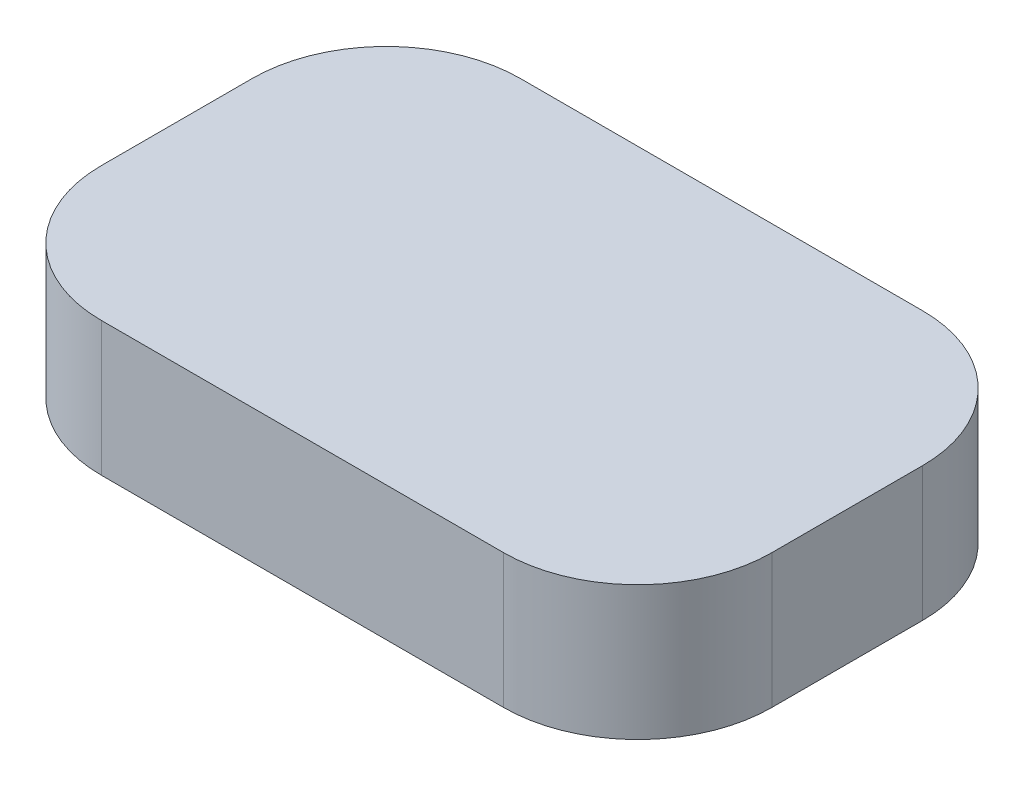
ISO-10303-21;
HEADER;
FILE_DESCRIPTION(('STEP AP214'),'2;1');
FILE_NAME('part.step','',(''),(''),'','','');
FILE_SCHEMA(('AUTOMOTIVE_DESIGN { 1 0 10303 214 1 1 1 1 }'));
ENDSEC;
DATA;
#1=APPLICATION_CONTEXT('core data for automotive mechanical design processes');
#2=APPLICATION_PROTOCOL_DEFINITION('international standard','automotive_design',2000,#1);
#3=PRODUCT_CONTEXT('',#1,'mechanical');
#4=PRODUCT('Part','Part','',(#3));
#5=PRODUCT_RELATED_PRODUCT_CATEGORY('part','',(#4));
#6=PRODUCT_DEFINITION_FORMATION('','',#4);
#7=PRODUCT_DEFINITION_CONTEXT('part definition',#1,'design');
#8=PRODUCT_DEFINITION('design','',#6,#7);
#9=PRODUCT_DEFINITION_SHAPE('','',#8);
#10=(LENGTH_UNIT() NAMED_UNIT(*) SI_UNIT(.MILLI.,.METRE.));
#11=(NAMED_UNIT(*) PLANE_ANGLE_UNIT() SI_UNIT($,.RADIAN.));
#12=(NAMED_UNIT(*) SI_UNIT($,.STERADIAN.) SOLID_ANGLE_UNIT());
#13=UNCERTAINTY_MEASURE_WITH_UNIT(LENGTH_MEASURE(1.E-05),#10,'distance_accuracy_value','');
#14=(GEOMETRIC_REPRESENTATION_CONTEXT(3) GLOBAL_UNCERTAINTY_ASSIGNED_CONTEXT((#13)) GLOBAL_UNIT_ASSIGNED_CONTEXT((#10,
#11,#12)) REPRESENTATION_CONTEXT('',''));
#15=CARTESIAN_POINT('',(0.,0.,0.));
#16=DIRECTION('',(0.,0.,1.));
#17=DIRECTION('',(1.,0.,0.));
#18=AXIS2_PLACEMENT_3D('',#15,#16,#17);
#19=CARTESIAN_POINT('',(-100.,40.,-62.5));
#20=DIRECTION('',(1.,0.,0.));
#21=DIRECTION('',(0.,0.,-1.));
#22=AXIS2_PLACEMENT_3D('',#19,#20,#21);
#23=PLANE('',#22);
#24=DIRECTION('',(0.,0.,1.));
#25=VECTOR('',#24,1.);
#26=CARTESIAN_POINT('',(-100.,40.,-62.5));
#27=LINE('',#26,#25);
#28=CARTESIAN_POINT('',(-100.,40.,-22.5));
#29=VERTEX_POINT('',#28);
#30=CARTESIAN_POINT('',(-100.,40.,22.5));
#31=VERTEX_POINT('',#30);
#32=EDGE_CURVE('E116',#29,#31,#27,.T.);
#33=ORIENTED_EDGE('',*,*,#32,.F.);
#34=DIRECTION('',(0.,-1.,0.));
#35=VECTOR('',#34,1.);
#36=CARTESIAN_POINT('',(-100.,40.,-22.5));
#37=LINE('',#36,#35);
#38=CARTESIAN_POINT('',(-100.,0.,-22.5));
#39=VERTEX_POINT('',#38);
#40=EDGE_CURVE('E101',#29,#39,#37,.T.);
#41=ORIENTED_EDGE('',*,*,#40,.T.);
#42=DIRECTION('',(0.,0.,1.));
#43=VECTOR('',#42,1.);
#44=CARTESIAN_POINT('',(-100.,0.,-62.5));
#45=LINE('',#44,#43);
#46=CARTESIAN_POINT('',(-100.,0.,22.5));
#47=VERTEX_POINT('',#46);
#48=EDGE_CURVE('E113',#39,#47,#45,.T.);
#49=ORIENTED_EDGE('',*,*,#48,.T.);
#50=DIRECTION('',(0.,-1.,0.));
#51=VECTOR('',#50,1.);
#52=CARTESIAN_POINT('',(-100.,40.,22.5));
#53=LINE('',#52,#51);
#54=EDGE_CURVE('E118',#47,#31,#53,.F.);
#55=ORIENTED_EDGE('',*,*,#54,.T.);
#56=EDGE_LOOP('',(#33,#41,#49,#55));
#57=FACE_BOUND('',#56,.T.);
#58=ADVANCED_FACE('F32',(#57),#23,.F.);
#59=CARTESIAN_POINT('',(-100.,40.,62.5));
#60=DIRECTION('',(0.,0.,-1.));
#61=DIRECTION('',(-1.,0.,0.));
#62=AXIS2_PLACEMENT_3D('',#59,#60,#61);
#63=PLANE('',#62);
#64=DIRECTION('',(1.,0.,0.));
#65=VECTOR('',#64,1.);
#66=CARTESIAN_POINT('',(-100.,40.,62.5));
#67=LINE('',#66,#65);
#68=CARTESIAN_POINT('',(-60.,40.,62.5));
#69=VERTEX_POINT('',#68);
#70=CARTESIAN_POINT('',(60.,40.,62.5));
#71=VERTEX_POINT('',#70);
#72=EDGE_CURVE('E167',#69,#71,#67,.T.);
#73=ORIENTED_EDGE('',*,*,#72,.F.);
#74=DIRECTION('',(0.,-1.,0.));
#75=VECTOR('',#74,1.);
#76=CARTESIAN_POINT('',(-60.,40.,62.5));
#77=LINE('',#76,#75);
#78=CARTESIAN_POINT('',(-60.,0.,62.5));
#79=VERTEX_POINT('',#78);
#80=EDGE_CURVE('E151',#69,#79,#77,.T.);
#81=ORIENTED_EDGE('',*,*,#80,.T.);
#82=DIRECTION('',(1.,0.,0.));
#83=VECTOR('',#82,1.);
#84=CARTESIAN_POINT('',(-100.,0.,62.5));
#85=LINE('',#84,#83);
#86=CARTESIAN_POINT('',(60.,0.,62.5));
#87=VERTEX_POINT('',#86);
#88=EDGE_CURVE('E122',#79,#87,#85,.T.);
#89=ORIENTED_EDGE('',*,*,#88,.T.);
#90=DIRECTION('',(0.,-1.,0.));
#91=VECTOR('',#90,1.);
#92=CARTESIAN_POINT('',(60.,40.,62.5));
#93=LINE('',#92,#91);
#94=EDGE_CURVE('E149',#87,#71,#93,.F.);
#95=ORIENTED_EDGE('',*,*,#94,.T.);
#96=EDGE_LOOP('',(#73,#81,#89,#95));
#97=FACE_BOUND('',#96,.T.);
#98=ADVANCED_FACE('F177',(#97),#63,.F.);
#99=CARTESIAN_POINT('',(100.,40.,-62.5));
#100=DIRECTION('',(-1.,0.,0.));
#101=DIRECTION('',(0.,0.,1.));
#102=AXIS2_PLACEMENT_3D('',#99,#100,#101);
#103=PLANE('',#102);
#104=DIRECTION('',(0.,0.,-1.));
#105=VECTOR('',#104,1.);
#106=CARTESIAN_POINT('',(100.,0.,-62.5));
#107=LINE('',#106,#105);
#108=CARTESIAN_POINT('',(100.,0.,22.5));
#109=VERTEX_POINT('',#108);
#110=CARTESIAN_POINT('',(100.,0.,-22.5));
#111=VERTEX_POINT('',#110);
#112=EDGE_CURVE('E125',#109,#111,#107,.T.);
#113=ORIENTED_EDGE('',*,*,#112,.T.);
#114=DIRECTION('',(0.,-1.,0.));
#115=VECTOR('',#114,1.);
#116=CARTESIAN_POINT('',(100.,40.,-22.5));
#117=LINE('',#116,#115);
#118=CARTESIAN_POINT('',(100.,40.,-22.5));
#119=VERTEX_POINT('',#118);
#120=EDGE_CURVE('E11',#111,#119,#117,.F.);
#121=ORIENTED_EDGE('',*,*,#120,.T.);
#122=DIRECTION('',(0.,0.,-1.));
#123=VECTOR('',#122,1.);
#124=CARTESIAN_POINT('',(100.,40.,-62.5));
#125=LINE('',#124,#123);
#126=CARTESIAN_POINT('',(100.,40.,22.5));
#127=VERTEX_POINT('',#126);
#128=EDGE_CURVE('E157',#127,#119,#125,.T.);
#129=ORIENTED_EDGE('',*,*,#128,.F.);
#130=DIRECTION('',(0.,-1.,0.));
#131=VECTOR('',#130,1.);
#132=CARTESIAN_POINT('',(100.,40.,22.5));
#133=LINE('',#132,#131);
#134=EDGE_CURVE('E40',#127,#109,#133,.T.);
#135=ORIENTED_EDGE('',*,*,#134,.T.);
#136=EDGE_LOOP('',(#113,#121,#129,#135));
#137=FACE_BOUND('',#136,.T.);
#138=ADVANCED_FACE('F156',(#137),#103,.F.);
#139=CARTESIAN_POINT('',(-100.,40.,-62.5));
#140=DIRECTION('',(0.,0.,1.));
#141=DIRECTION('',(1.,0.,0.));
#142=AXIS2_PLACEMENT_3D('',#139,#140,#141);
#143=PLANE('',#142);
#144=DIRECTION('',(-1.,0.,0.));
#145=VECTOR('',#144,1.);
#146=CARTESIAN_POINT('',(-100.,0.,-62.5));
#147=LINE('',#146,#145);
#148=CARTESIAN_POINT('',(60.,0.,-62.5));
#149=VERTEX_POINT('',#148);
#150=CARTESIAN_POINT('',(-60.,0.,-62.5));
#151=VERTEX_POINT('',#150);
#152=EDGE_CURVE('E132',#149,#151,#147,.T.);
#153=ORIENTED_EDGE('',*,*,#152,.T.);
#154=DIRECTION('',(0.,-1.,0.));
#155=VECTOR('',#154,1.);
#156=CARTESIAN_POINT('',(-60.,40.,-62.5));
#157=LINE('',#156,#155);
#158=CARTESIAN_POINT('',(-60.,40.,-62.5));
#159=VERTEX_POINT('',#158);
#160=EDGE_CURVE('E102',#151,#159,#157,.F.);
#161=ORIENTED_EDGE('',*,*,#160,.T.);
#162=DIRECTION('',(-1.,0.,0.));
#163=VECTOR('',#162,1.);
#164=CARTESIAN_POINT('',(-100.,40.,-62.5));
#165=LINE('',#164,#163);
#166=CARTESIAN_POINT('',(60.,40.,-62.5));
#167=VERTEX_POINT('',#166);
#168=EDGE_CURVE('E128',#167,#159,#165,.T.);
#169=ORIENTED_EDGE('',*,*,#168,.F.);
#170=DIRECTION('',(0.,-1.,0.));
#171=VECTOR('',#170,1.);
#172=CARTESIAN_POINT('',(60.,40.,-62.5));
#173=LINE('',#172,#171);
#174=EDGE_CURVE('E107',#167,#149,#173,.T.);
#175=ORIENTED_EDGE('',*,*,#174,.T.);
#176=EDGE_LOOP('',(#153,#161,#169,#175));
#177=FACE_BOUND('',#176,.T.);
#178=ADVANCED_FACE('F165',(#177),#143,.F.);
#179=CARTESIAN_POINT('',(-100.,40.,62.5));
#180=DIRECTION('',(0.,1.,0.));
#181=DIRECTION('',(0.,0.,1.));
#182=AXIS2_PLACEMENT_3D('',#179,#180,#181);
#183=PLANE('',#182);
#184=ORIENTED_EDGE('',*,*,#168,.T.);
#185=CARTESIAN_POINT('',(-60.,40.,-22.5));
#186=DIRECTION('',(0.,1.,0.));
#187=DIRECTION('',(0.,0.,1.));
#188=AXIS2_PLACEMENT_3D('',#185,#186,#187);
#189=CIRCLE('',#188,40.);
#190=EDGE_CURVE('E147',#159,#29,#189,.T.);
#191=ORIENTED_EDGE('',*,*,#190,.T.);
#192=ORIENTED_EDGE('',*,*,#32,.T.);
#193=CARTESIAN_POINT('',(-60.,40.,22.5));
#194=DIRECTION('',(0.,1.,0.));
#195=DIRECTION('',(0.,0.,1.));
#196=AXIS2_PLACEMENT_3D('',#193,#194,#195);
#197=CIRCLE('',#196,40.);
#198=EDGE_CURVE('E145',#31,#69,#197,.T.);
#199=ORIENTED_EDGE('',*,*,#198,.T.);
#200=ORIENTED_EDGE('',*,*,#72,.T.);
#201=CARTESIAN_POINT('',(60.,40.,22.5));
#202=DIRECTION('',(0.,1.,0.));
#203=DIRECTION('',(0.,0.,1.));
#204=AXIS2_PLACEMENT_3D('',#201,#202,#203);
#205=CIRCLE('',#204,40.);
#206=EDGE_CURVE('E52',#71,#127,#205,.T.);
#207=ORIENTED_EDGE('',*,*,#206,.T.);
#208=ORIENTED_EDGE('',*,*,#128,.T.);
#209=CARTESIAN_POINT('',(60.,40.,-22.5));
#210=DIRECTION('',(0.,1.,0.));
#211=DIRECTION('',(0.,0.,1.));
#212=AXIS2_PLACEMENT_3D('',#209,#210,#211);
#213=CIRCLE('',#212,40.);
#214=EDGE_CURVE('E143',#119,#167,#213,.T.);
#215=ORIENTED_EDGE('',*,*,#214,.T.);
#216=EDGE_LOOP('',(#184,#191,#192,#199,#200,#207,#208,#215));
#217=FACE_BOUND('',#216,.T.);
#218=ADVANCED_FACE('F171',(#217),#183,.T.);
#219=CARTESIAN_POINT('',(-100.,0.,62.5));
#220=DIRECTION('',(0.,1.,0.));
#221=DIRECTION('',(0.,0.,1.));
#222=AXIS2_PLACEMENT_3D('',#219,#220,#221);
#223=PLANE('',#222);
#224=ORIENTED_EDGE('',*,*,#48,.F.);
#225=CARTESIAN_POINT('',(-60.,0.,-22.5));
#226=DIRECTION('',(0.,1.,0.));
#227=DIRECTION('',(0.,0.,1.));
#228=AXIS2_PLACEMENT_3D('',#225,#226,#227);
#229=CIRCLE('',#228,40.);
#230=EDGE_CURVE('E97',#39,#151,#229,.F.);
#231=ORIENTED_EDGE('',*,*,#230,.T.);
#232=ORIENTED_EDGE('',*,*,#152,.F.);
#233=CARTESIAN_POINT('',(60.,0.,-22.5));
#234=DIRECTION('',(0.,1.,0.));
#235=DIRECTION('',(0.,0.,1.));
#236=AXIS2_PLACEMENT_3D('',#233,#234,#235);
#237=CIRCLE('',#236,40.);
#238=EDGE_CURVE('E136',#149,#111,#237,.F.);
#239=ORIENTED_EDGE('',*,*,#238,.T.);
#240=ORIENTED_EDGE('',*,*,#112,.F.);
#241=CARTESIAN_POINT('',(60.,0.,22.5));
#242=DIRECTION('',(0.,1.,0.));
#243=DIRECTION('',(0.,0.,1.));
#244=AXIS2_PLACEMENT_3D('',#241,#242,#243);
#245=CIRCLE('',#244,40.);
#246=EDGE_CURVE('E117',#109,#87,#245,.F.);
#247=ORIENTED_EDGE('',*,*,#246,.T.);
#248=ORIENTED_EDGE('',*,*,#88,.F.);
#249=CARTESIAN_POINT('',(-60.,0.,22.5));
#250=DIRECTION('',(0.,1.,0.));
#251=DIRECTION('',(0.,0.,1.));
#252=AXIS2_PLACEMENT_3D('',#249,#250,#251);
#253=CIRCLE('',#252,40.);
#254=EDGE_CURVE('E108',#79,#47,#253,.F.);
#255=ORIENTED_EDGE('',*,*,#254,.T.);
#256=EDGE_LOOP('',(#224,#231,#232,#239,#240,#247,#248,#255));
#257=FACE_BOUND('',#256,.T.);
#258=ADVANCED_FACE('F120',(#257),#223,.F.);
#259=CARTESIAN_POINT('',(-60.,40.,-22.5));
#260=DIRECTION('',(0.,-1.,0.));
#261=DIRECTION('',(0.,0.,-1.));
#262=AXIS2_PLACEMENT_3D('',#259,#260,#261);
#263=CYLINDRICAL_SURFACE('',#262,40.);
#264=ORIENTED_EDGE('',*,*,#190,.F.);
#265=ORIENTED_EDGE('',*,*,#160,.F.);
#266=ORIENTED_EDGE('',*,*,#230,.F.);
#267=ORIENTED_EDGE('',*,*,#40,.F.);
#268=EDGE_LOOP('',(#264,#265,#266,#267));
#269=FACE_BOUND('',#268,.T.);
#270=ADVANCED_FACE('F100',(#269),#263,.T.);
#271=CARTESIAN_POINT('',(-60.,40.,22.5));
#272=DIRECTION('',(0.,-1.,0.));
#273=DIRECTION('',(0.,0.,-1.));
#274=AXIS2_PLACEMENT_3D('',#271,#272,#273);
#275=CYLINDRICAL_SURFACE('',#274,40.);
#276=ORIENTED_EDGE('',*,*,#198,.F.);
#277=ORIENTED_EDGE('',*,*,#54,.F.);
#278=ORIENTED_EDGE('',*,*,#254,.F.);
#279=ORIENTED_EDGE('',*,*,#80,.F.);
#280=EDGE_LOOP('',(#276,#277,#278,#279));
#281=FACE_BOUND('',#280,.T.);
#282=ADVANCED_FACE('F175',(#281),#275,.T.);
#283=CARTESIAN_POINT('',(60.,40.,-22.5));
#284=DIRECTION('',(0.,-1.,0.));
#285=DIRECTION('',(0.,0.,-1.));
#286=AXIS2_PLACEMENT_3D('',#283,#284,#285);
#287=CYLINDRICAL_SURFACE('',#286,40.);
#288=ORIENTED_EDGE('',*,*,#214,.F.);
#289=ORIENTED_EDGE('',*,*,#120,.F.);
#290=ORIENTED_EDGE('',*,*,#238,.F.);
#291=ORIENTED_EDGE('',*,*,#174,.F.);
#292=EDGE_LOOP('',(#288,#289,#290,#291));
#293=FACE_BOUND('',#292,.T.);
#294=ADVANCED_FACE('F162',(#293),#287,.T.);
#295=CARTESIAN_POINT('',(60.,40.,22.5));
#296=DIRECTION('',(0.,-1.,0.));
#297=DIRECTION('',(0.,0.,-1.));
#298=AXIS2_PLACEMENT_3D('',#295,#296,#297);
#299=CYLINDRICAL_SURFACE('',#298,40.);
#300=ORIENTED_EDGE('',*,*,#206,.F.);
#301=ORIENTED_EDGE('',*,*,#94,.F.);
#302=ORIENTED_EDGE('',*,*,#246,.F.);
#303=ORIENTED_EDGE('',*,*,#134,.F.);
#304=EDGE_LOOP('',(#300,#301,#302,#303));
#305=FACE_BOUND('',#304,.T.);
#306=ADVANCED_FACE('F34',(#305),#299,.T.);
#307=CLOSED_SHELL('',(#58,#98,#138,#178,#218,#258,#270,#282,#294,#306));
#308=MANIFOLD_SOLID_BREP('B2',#307);
#309=ADVANCED_BREP_SHAPE_REPRESENTATION('',(#18,#308),#14);
#310=SHAPE_DEFINITION_REPRESENTATION(#9,#309);
ENDSEC;
END-ISO-10303-21;
